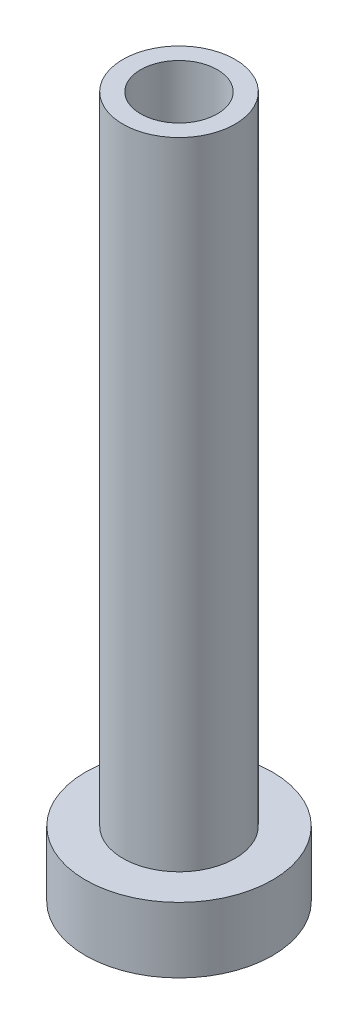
ISO-10303-21;
HEADER;
FILE_DESCRIPTION(('STEP AP214'),'2;1');
FILE_NAME('part.step','',(''),(''),'','','');
FILE_SCHEMA(('AUTOMOTIVE_DESIGN { 1 0 10303 214 1 1 1 1 }'));
ENDSEC;
DATA;
#1=APPLICATION_CONTEXT('core data for automotive mechanical design processes');
#2=APPLICATION_PROTOCOL_DEFINITION('international standard','automotive_design',2000,#1);
#3=PRODUCT_CONTEXT('',#1,'mechanical');
#4=PRODUCT('Part','Part','',(#3));
#5=PRODUCT_RELATED_PRODUCT_CATEGORY('part','',(#4));
#6=PRODUCT_DEFINITION_FORMATION('','',#4);
#7=PRODUCT_DEFINITION_CONTEXT('part definition',#1,'design');
#8=PRODUCT_DEFINITION('design','',#6,#7);
#9=PRODUCT_DEFINITION_SHAPE('','',#8);
#10=(LENGTH_UNIT() NAMED_UNIT(*) SI_UNIT(.MILLI.,.METRE.));
#11=(NAMED_UNIT(*) PLANE_ANGLE_UNIT() SI_UNIT($,.RADIAN.));
#12=(NAMED_UNIT(*) SI_UNIT($,.STERADIAN.) SOLID_ANGLE_UNIT());
#13=UNCERTAINTY_MEASURE_WITH_UNIT(LENGTH_MEASURE(1.E-05),#10,'distance_accuracy_value','');
#14=(GEOMETRIC_REPRESENTATION_CONTEXT(3) GLOBAL_UNCERTAINTY_ASSIGNED_CONTEXT((#13)) GLOBAL_UNIT_ASSIGNED_CONTEXT((#10,
#11,#12)) REPRESENTATION_CONTEXT('',''));
#15=CARTESIAN_POINT('',(0.,0.,0.));
#16=DIRECTION('',(0.,0.,1.));
#17=DIRECTION('',(1.,0.,0.));
#18=AXIS2_PLACEMENT_3D('',#15,#16,#17);
#19=CARTESIAN_POINT('',(0.,0.,0.));
#20=DIRECTION('',(0.,-1.,0.));
#21=DIRECTION('',(0.,0.,-1.));
#22=AXIS2_PLACEMENT_3D('',#19,#20,#21);
#23=CYLINDRICAL_SURFACE('',#22,10.);
#24=CARTESIAN_POINT('',(0.,-7.,0.));
#25=DIRECTION('',(0.,-1.,0.));
#26=DIRECTION('',(0.,0.,-1.));
#27=AXIS2_PLACEMENT_3D('',#24,#25,#26);
#28=CIRCLE('',#27,10.);
#29=CARTESIAN_POINT('',(0.,-7.,-10.));
#30=VERTEX_POINT('',#29);
#31=EDGE_CURVE('E42',#30,#30,#28,.T.);
#32=ORIENTED_EDGE('',*,*,#31,.F.);
#33=EDGE_LOOP('',(#32));
#34=FACE_BOUND('',#33,.T.);
#35=CARTESIAN_POINT('',(0.,0.,0.));
#36=DIRECTION('',(0.,-1.,0.));
#37=DIRECTION('',(0.,0.,-1.));
#38=AXIS2_PLACEMENT_3D('',#35,#36,#37);
#39=CIRCLE('',#38,10.);
#40=CARTESIAN_POINT('',(0.,0.,-10.));
#41=VERTEX_POINT('',#40);
#42=EDGE_CURVE('E9',#41,#41,#39,.T.);
#43=ORIENTED_EDGE('',*,*,#42,.T.);
#44=EDGE_LOOP('',(#43));
#45=FACE_BOUND('',#44,.T.);
#46=ADVANCED_FACE('F14',(#34,#45),#23,.T.);
#47=CARTESIAN_POINT('',(-10.,0.,0.));
#48=DIRECTION('',(0.,-1.,0.));
#49=DIRECTION('',(0.,0.,-1.));
#50=AXIS2_PLACEMENT_3D('',#47,#48,#49);
#51=PLANE('',#50);
#52=ORIENTED_EDGE('',*,*,#42,.F.);
#53=EDGE_LOOP('',(#52));
#54=FACE_BOUND('',#53,.T.);
#55=CARTESIAN_POINT('',(0.,0.,0.));
#56=DIRECTION('',(0.,-1.,0.));
#57=DIRECTION('',(0.,0.,-1.));
#58=AXIS2_PLACEMENT_3D('',#55,#56,#57);
#59=CIRCLE('',#58,6.);
#60=CARTESIAN_POINT('',(0.,0.,-6.));
#61=VERTEX_POINT('',#60);
#62=EDGE_CURVE('E20',#61,#61,#59,.T.);
#63=ORIENTED_EDGE('',*,*,#62,.T.);
#64=EDGE_LOOP('',(#63));
#65=FACE_BOUND('',#64,.T.);
#66=ADVANCED_FACE('F49',(#54,#65),#51,.F.);
#67=CARTESIAN_POINT('',(0.,0.,0.));
#68=DIRECTION('',(0.,-1.,0.));
#69=DIRECTION('',(0.,0.,-1.));
#70=AXIS2_PLACEMENT_3D('',#67,#68,#69);
#71=CYLINDRICAL_SURFACE('',#70,6.);
#72=ORIENTED_EDGE('',*,*,#62,.F.);
#73=EDGE_LOOP('',(#72));
#74=FACE_BOUND('',#73,.T.);
#75=CARTESIAN_POINT('',(0.,68.,0.));
#76=DIRECTION('',(0.,-1.,0.));
#77=DIRECTION('',(0.,0.,-1.));
#78=AXIS2_PLACEMENT_3D('',#75,#76,#77);
#79=CIRCLE('',#78,6.);
#80=CARTESIAN_POINT('',(0.,68.,-6.));
#81=VERTEX_POINT('',#80);
#82=EDGE_CURVE('E24',#81,#81,#79,.T.);
#83=ORIENTED_EDGE('',*,*,#82,.T.);
#84=EDGE_LOOP('',(#83));
#85=FACE_BOUND('',#84,.T.);
#86=ADVANCED_FACE('F55',(#74,#85),#71,.T.);
#87=CARTESIAN_POINT('',(-6.,68.,0.));
#88=DIRECTION('',(0.,-1.,0.));
#89=DIRECTION('',(0.,0.,-1.));
#90=AXIS2_PLACEMENT_3D('',#87,#88,#89);
#91=PLANE('',#90);
#92=ORIENTED_EDGE('',*,*,#82,.F.);
#93=EDGE_LOOP('',(#92));
#94=FACE_BOUND('',#93,.T.);
#95=CARTESIAN_POINT('',(0.,68.,0.));
#96=DIRECTION('',(0.,-1.,0.));
#97=DIRECTION('',(0.,0.,-1.));
#98=AXIS2_PLACEMENT_3D('',#95,#96,#97);
#99=CIRCLE('',#98,4.1);
#100=CARTESIAN_POINT('',(0.,68.,-4.1));
#101=VERTEX_POINT('',#100);
#102=EDGE_CURVE('E28',#101,#101,#99,.T.);
#103=ORIENTED_EDGE('',*,*,#102,.T.);
#104=EDGE_LOOP('',(#103));
#105=FACE_BOUND('',#104,.T.);
#106=ADVANCED_FACE('F61',(#94,#105),#91,.F.);
#107=CARTESIAN_POINT('',(0.,0.,0.));
#108=DIRECTION('',(0.,-1.,0.));
#109=DIRECTION('',(0.,0.,-1.));
#110=AXIS2_PLACEMENT_3D('',#107,#108,#109);
#111=CYLINDRICAL_SURFACE('',#110,4.1);
#112=ORIENTED_EDGE('',*,*,#102,.F.);
#113=EDGE_LOOP('',(#112));
#114=FACE_BOUND('',#113,.T.);
#115=CARTESIAN_POINT('',(0.,23.,0.));
#116=DIRECTION('',(0.,-1.,0.));
#117=DIRECTION('',(0.,0.,-1.));
#118=AXIS2_PLACEMENT_3D('',#115,#116,#117);
#119=CIRCLE('',#118,4.1);
#120=CARTESIAN_POINT('',(0.,23.,-4.1));
#121=VERTEX_POINT('',#120);
#122=EDGE_CURVE('E33',#121,#121,#119,.T.);
#123=ORIENTED_EDGE('',*,*,#122,.T.);
#124=EDGE_LOOP('',(#123));
#125=FACE_BOUND('',#124,.T.);
#126=ADVANCED_FACE('F67',(#114,#125),#111,.F.);
#127=CARTESIAN_POINT('',(0.,22.85,0.));
#128=DIRECTION('',(0.,-1.,0.));
#129=DIRECTION('',(0.,0.,-1.));
#130=AXIS2_PLACEMENT_3D('',#127,#128,#129);
#131=CONICAL_SURFACE('',#130,4.25,0.785398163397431);
#132=ORIENTED_EDGE('',*,*,#122,.F.);
#133=EDGE_LOOP('',(#132));
#134=FACE_BOUND('',#133,.T.);
#135=CARTESIAN_POINT('',(0.,22.85,0.));
#136=DIRECTION('',(0.,-1.,0.));
#137=DIRECTION('',(0.,0.,-1.));
#138=AXIS2_PLACEMENT_3D('',#135,#136,#137);
#139=CIRCLE('',#138,4.25);
#140=CARTESIAN_POINT('',(0.,22.85,-4.25));
#141=VERTEX_POINT('',#140);
#142=EDGE_CURVE('E36',#141,#141,#139,.T.);
#143=ORIENTED_EDGE('',*,*,#142,.T.);
#144=EDGE_LOOP('',(#143));
#145=FACE_BOUND('',#144,.T.);
#146=ADVANCED_FACE('F71',(#134,#145),#131,.F.);
#147=CARTESIAN_POINT('',(0.,0.,0.));
#148=DIRECTION('',(0.,-1.,0.));
#149=DIRECTION('',(0.,0.,-1.));
#150=AXIS2_PLACEMENT_3D('',#147,#148,#149);
#151=CYLINDRICAL_SURFACE('',#150,4.25);
#152=ORIENTED_EDGE('',*,*,#142,.F.);
#153=EDGE_LOOP('',(#152));
#154=FACE_BOUND('',#153,.T.);
#155=CARTESIAN_POINT('',(0.,-7.,0.));
#156=DIRECTION('',(0.,-1.,0.));
#157=DIRECTION('',(0.,0.,-1.));
#158=AXIS2_PLACEMENT_3D('',#155,#156,#157);
#159=CIRCLE('',#158,4.25);
#160=CARTESIAN_POINT('',(0.,-7.,-4.25));
#161=VERTEX_POINT('',#160);
#162=EDGE_CURVE('E39',#161,#161,#159,.T.);
#163=ORIENTED_EDGE('',*,*,#162,.T.);
#164=EDGE_LOOP('',(#163));
#165=FACE_BOUND('',#164,.T.);
#166=ADVANCED_FACE('F75',(#154,#165),#151,.F.);
#167=CARTESIAN_POINT('',(-4.25,-7.,0.));
#168=DIRECTION('',(0.,1.,0.));
#169=DIRECTION('',(0.,0.,1.));
#170=AXIS2_PLACEMENT_3D('',#167,#168,#169);
#171=PLANE('',#170);
#172=ORIENTED_EDGE('',*,*,#162,.F.);
#173=EDGE_LOOP('',(#172));
#174=FACE_BOUND('',#173,.T.);
#175=ORIENTED_EDGE('',*,*,#31,.T.);
#176=EDGE_LOOP('',(#175));
#177=FACE_BOUND('',#176,.T.);
#178=ADVANCED_FACE('F46',(#174,#177),#171,.F.);
#179=CLOSED_SHELL('',(#46,#66,#86,#106,#126,#146,#166,#178));
#180=MANIFOLD_SOLID_BREP('B1',#179);
#181=ADVANCED_BREP_SHAPE_REPRESENTATION('',(#18,#180),#14);
#182=SHAPE_DEFINITION_REPRESENTATION(#9,#181);
ENDSEC;
END-ISO-10303-21;
